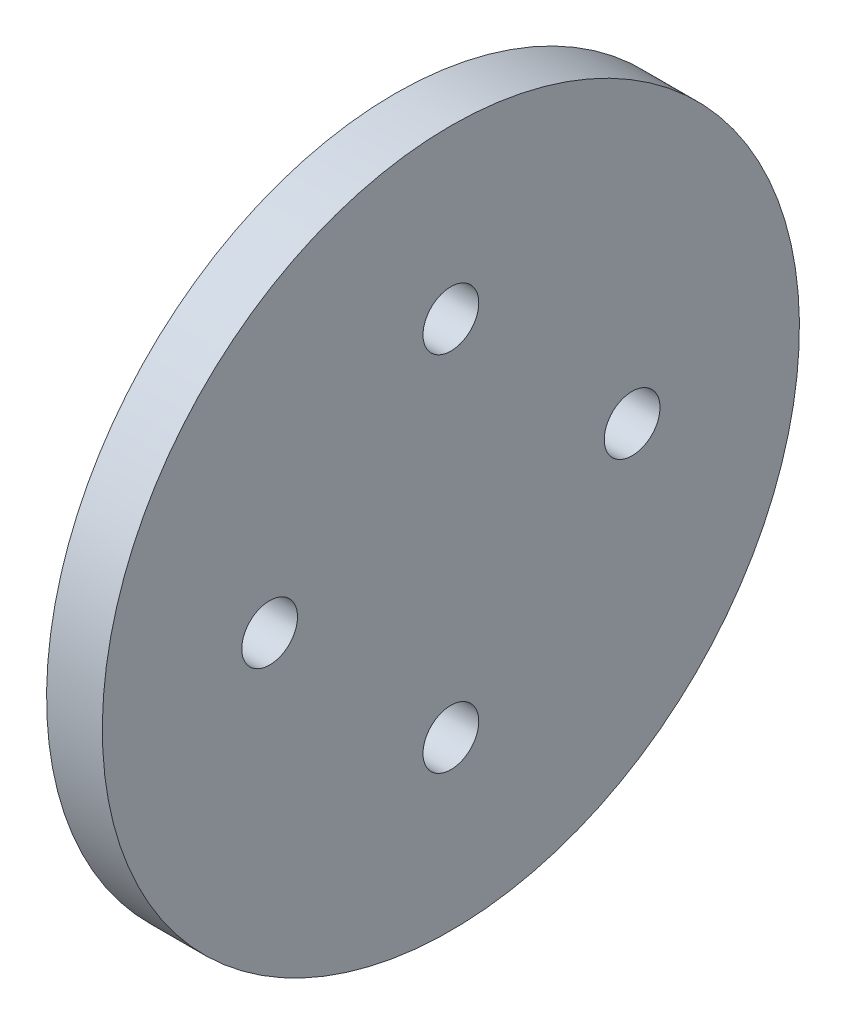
ISO-10303-21;
HEADER;
FILE_DESCRIPTION(('STEP AP214'),'2;1');
FILE_NAME('part.step','',(''),(''),'','','');
FILE_SCHEMA(('AUTOMOTIVE_DESIGN { 1 0 10303 214 1 1 1 1 }'));
ENDSEC;
DATA;
#1=APPLICATION_CONTEXT('core data for automotive mechanical design processes');
#2=APPLICATION_PROTOCOL_DEFINITION('international standard','automotive_design',2000,#1);
#3=PRODUCT_CONTEXT('',#1,'mechanical');
#4=PRODUCT('Part','Part','',(#3));
#5=PRODUCT_RELATED_PRODUCT_CATEGORY('part','',(#4));
#6=PRODUCT_DEFINITION_FORMATION('','',#4);
#7=PRODUCT_DEFINITION_CONTEXT('part definition',#1,'design');
#8=PRODUCT_DEFINITION('design','',#6,#7);
#9=PRODUCT_DEFINITION_SHAPE('','',#8);
#10=(LENGTH_UNIT() NAMED_UNIT(*) SI_UNIT(.MILLI.,.METRE.));
#11=(NAMED_UNIT(*) PLANE_ANGLE_UNIT() SI_UNIT($,.RADIAN.));
#12=(NAMED_UNIT(*) SI_UNIT($,.STERADIAN.) SOLID_ANGLE_UNIT());
#13=UNCERTAINTY_MEASURE_WITH_UNIT(LENGTH_MEASURE(1.E-05),#10,'distance_accuracy_value','');
#14=(GEOMETRIC_REPRESENTATION_CONTEXT(3) GLOBAL_UNCERTAINTY_ASSIGNED_CONTEXT((#13)) GLOBAL_UNIT_ASSIGNED_CONTEXT((#10,
#11,#12)) REPRESENTATION_CONTEXT('',''));
#15=CARTESIAN_POINT('',(0.,0.,0.));
#16=DIRECTION('',(0.,0.,1.));
#17=DIRECTION('',(1.,0.,0.));
#18=AXIS2_PLACEMENT_3D('',#15,#16,#17);
#19=CARTESIAN_POINT('',(0.,0.,0.));
#20=DIRECTION('',(1.,0.,0.));
#21=DIRECTION('',(0.,1.,0.));
#22=AXIS2_PLACEMENT_3D('',#19,#20,#21);
#23=PLANE('',#22);
#24=CARTESIAN_POINT('',(0.,0.,-6.5));
#25=DIRECTION('',(1.,0.,0.));
#26=DIRECTION('',(0.,1.,0.));
#27=AXIS2_PLACEMENT_3D('',#24,#25,#26);
#28=CIRCLE('',#27,1.);
#29=CARTESIAN_POINT('',(0.,1.,-6.5));
#30=VERTEX_POINT('',#29);
#31=EDGE_CURVE('E58',#30,#30,#28,.T.);
#32=ORIENTED_EDGE('',*,*,#31,.F.);
#33=EDGE_LOOP('',(#32));
#34=FACE_BOUND('',#33,.T.);
#35=CARTESIAN_POINT('',(0.,-6.5,0.));
#36=DIRECTION('',(1.,0.,0.));
#37=DIRECTION('',(0.,1.,0.));
#38=AXIS2_PLACEMENT_3D('',#35,#36,#37);
#39=CIRCLE('',#38,1.);
#40=CARTESIAN_POINT('',(0.,-5.5,0.));
#41=VERTEX_POINT('',#40);
#42=EDGE_CURVE('E48',#41,#41,#39,.T.);
#43=ORIENTED_EDGE('',*,*,#42,.F.);
#44=EDGE_LOOP('',(#43));
#45=FACE_BOUND('',#44,.T.);
#46=CARTESIAN_POINT('',(0.,6.5,0.));
#47=DIRECTION('',(1.,0.,0.));
#48=DIRECTION('',(0.,1.,0.));
#49=AXIS2_PLACEMENT_3D('',#46,#47,#48);
#50=CIRCLE('',#49,1.);
#51=CARTESIAN_POINT('',(0.,7.5,0.));
#52=VERTEX_POINT('',#51);
#53=EDGE_CURVE('E45',#52,#52,#50,.T.);
#54=ORIENTED_EDGE('',*,*,#53,.F.);
#55=EDGE_LOOP('',(#54));
#56=FACE_BOUND('',#55,.T.);
#57=CARTESIAN_POINT('',(0.,0.,6.5));
#58=DIRECTION('',(1.,0.,0.));
#59=DIRECTION('',(0.,1.,0.));
#60=AXIS2_PLACEMENT_3D('',#57,#58,#59);
#61=CIRCLE('',#60,1.);
#62=CARTESIAN_POINT('',(0.,1.,6.5));
#63=VERTEX_POINT('',#62);
#64=EDGE_CURVE('E42',#63,#63,#61,.T.);
#65=ORIENTED_EDGE('',*,*,#64,.F.);
#66=EDGE_LOOP('',(#65));
#67=FACE_BOUND('',#66,.T.);
#68=CARTESIAN_POINT('',(0.,0.,0.));
#69=DIRECTION('',(1.,0.,0.));
#70=DIRECTION('',(0.,1.,0.));
#71=AXIS2_PLACEMENT_3D('',#68,#69,#70);
#72=CIRCLE('',#71,12.5);
#73=CARTESIAN_POINT('',(0.,12.5,0.));
#74=VERTEX_POINT('',#73);
#75=EDGE_CURVE('E10',#74,#74,#72,.T.);
#76=ORIENTED_EDGE('',*,*,#75,.T.);
#77=EDGE_LOOP('',(#76));
#78=FACE_BOUND('',#77,.T.);
#79=ADVANCED_FACE('F22',(#34,#45,#56,#67,#78),#23,.T.);
#80=CARTESIAN_POINT('',(0.,0.,0.));
#81=DIRECTION('',(1.,0.,0.));
#82=DIRECTION('',(0.,1.,0.));
#83=AXIS2_PLACEMENT_3D('',#80,#81,#82);
#84=CYLINDRICAL_SURFACE('',#83,12.5);
#85=CARTESIAN_POINT('',(-2.,0.,0.));
#86=DIRECTION('',(1.,0.,0.));
#87=DIRECTION('',(0.,1.,0.));
#88=AXIS2_PLACEMENT_3D('',#85,#86,#87);
#89=CIRCLE('',#88,12.5);
#90=CARTESIAN_POINT('',(-2.,12.5,0.));
#91=VERTEX_POINT('',#90);
#92=EDGE_CURVE('E29',#91,#91,#89,.T.);
#93=ORIENTED_EDGE('',*,*,#92,.T.);
#94=EDGE_LOOP('',(#93));
#95=FACE_BOUND('',#94,.T.);
#96=ORIENTED_EDGE('',*,*,#75,.F.);
#97=EDGE_LOOP('',(#96));
#98=FACE_BOUND('',#97,.T.);
#99=ADVANCED_FACE('F85',(#95,#98),#84,.T.);
#100=CARTESIAN_POINT('',(-2.,12.5,0.));
#101=DIRECTION('',(-1.,0.,0.));
#102=DIRECTION('',(0.,-1.,0.));
#103=AXIS2_PLACEMENT_3D('',#100,#101,#102);
#104=PLANE('',#103);
#105=CARTESIAN_POINT('',(-2.,0.,-6.5));
#106=DIRECTION('',(-1.,0.,0.));
#107=DIRECTION('',(0.,-1.,0.));
#108=AXIS2_PLACEMENT_3D('',#105,#106,#107);
#109=CIRCLE('',#108,1.);
#110=CARTESIAN_POINT('',(-2.,1.,-6.5));
#111=VERTEX_POINT('',#110);
#112=EDGE_CURVE('E25',#111,#111,#109,.T.);
#113=ORIENTED_EDGE('',*,*,#112,.F.);
#114=EDGE_LOOP('',(#113));
#115=FACE_BOUND('',#114,.T.);
#116=CARTESIAN_POINT('',(-2.,-6.5,0.));
#117=DIRECTION('',(-1.,0.,0.));
#118=DIRECTION('',(0.,-1.,0.));
#119=AXIS2_PLACEMENT_3D('',#116,#117,#118);
#120=CIRCLE('',#119,1.);
#121=CARTESIAN_POINT('',(-2.,-5.5,0.));
#122=VERTEX_POINT('',#121);
#123=EDGE_CURVE('E46',#122,#122,#120,.T.);
#124=ORIENTED_EDGE('',*,*,#123,.F.);
#125=EDGE_LOOP('',(#124));
#126=FACE_BOUND('',#125,.T.);
#127=CARTESIAN_POINT('',(-2.,6.5,0.));
#128=DIRECTION('',(-1.,0.,0.));
#129=DIRECTION('',(0.,-1.,0.));
#130=AXIS2_PLACEMENT_3D('',#127,#128,#129);
#131=CIRCLE('',#130,1.);
#132=CARTESIAN_POINT('',(-2.,7.5,0.));
#133=VERTEX_POINT('',#132);
#134=EDGE_CURVE('E43',#133,#133,#131,.T.);
#135=ORIENTED_EDGE('',*,*,#134,.F.);
#136=EDGE_LOOP('',(#135));
#137=FACE_BOUND('',#136,.T.);
#138=CARTESIAN_POINT('',(-2.,0.,6.5));
#139=DIRECTION('',(-1.,0.,0.));
#140=DIRECTION('',(0.,-1.,0.));
#141=AXIS2_PLACEMENT_3D('',#138,#139,#140);
#142=CIRCLE('',#141,1.);
#143=CARTESIAN_POINT('',(-2.,1.,6.5));
#144=VERTEX_POINT('',#143);
#145=EDGE_CURVE('E38',#144,#144,#142,.T.);
#146=ORIENTED_EDGE('',*,*,#145,.F.);
#147=EDGE_LOOP('',(#146));
#148=FACE_BOUND('',#147,.T.);
#149=CARTESIAN_POINT('',(-2.,0.,0.));
#150=DIRECTION('',(1.,0.,0.));
#151=DIRECTION('',(0.,1.,0.));
#152=AXIS2_PLACEMENT_3D('',#149,#150,#151);
#153=CIRCLE('',#152,3.);
#154=CARTESIAN_POINT('',(-2.,3.,0.));
#155=VERTEX_POINT('',#154);
#156=EDGE_CURVE('E34',#155,#155,#153,.T.);
#157=ORIENTED_EDGE('',*,*,#156,.T.);
#158=EDGE_LOOP('',(#157));
#159=FACE_BOUND('',#158,.T.);
#160=ORIENTED_EDGE('',*,*,#92,.F.);
#161=EDGE_LOOP('',(#160));
#162=FACE_BOUND('',#161,.T.);
#163=ADVANCED_FACE('F70',(#115,#126,#137,#148,#159,#162),#104,.T.);
#164=CARTESIAN_POINT('',(0.,0.,0.));
#165=DIRECTION('',(1.,0.,0.));
#166=DIRECTION('',(0.,1.,0.));
#167=AXIS2_PLACEMENT_3D('',#164,#165,#166);
#168=CYLINDRICAL_SURFACE('',#167,3.);
#169=CARTESIAN_POINT('',(-4.,0.,0.));
#170=DIRECTION('',(1.,0.,0.));
#171=DIRECTION('',(0.,1.,0.));
#172=AXIS2_PLACEMENT_3D('',#169,#170,#171);
#173=CIRCLE('',#172,3.);
#174=CARTESIAN_POINT('',(-4.,3.,0.));
#175=VERTEX_POINT('',#174);
#176=EDGE_CURVE('E65',#175,#175,#173,.T.);
#177=ORIENTED_EDGE('',*,*,#176,.T.);
#178=EDGE_LOOP('',(#177));
#179=FACE_BOUND('',#178,.T.);
#180=ORIENTED_EDGE('',*,*,#156,.F.);
#181=EDGE_LOOP('',(#180));
#182=FACE_BOUND('',#181,.T.);
#183=ADVANCED_FACE('F73',(#179,#182),#168,.T.);
#184=CARTESIAN_POINT('',(-4.,0.,0.));
#185=DIRECTION('',(1.,0.,0.));
#186=DIRECTION('',(0.,1.,0.));
#187=AXIS2_PLACEMENT_3D('',#184,#185,#186);
#188=CONICAL_SURFACE('',#187,3.,0.785398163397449);
#189=CARTESIAN_POINT('',(-5.,0.,0.));
#190=DIRECTION('',(1.,0.,0.));
#191=DIRECTION('',(0.,1.,0.));
#192=AXIS2_PLACEMENT_3D('',#189,#190,#191);
#193=CIRCLE('',#192,2.);
#194=CARTESIAN_POINT('',(-5.,2.,0.));
#195=VERTEX_POINT('',#194);
#196=EDGE_CURVE('E41',#195,#195,#193,.T.);
#197=ORIENTED_EDGE('',*,*,#196,.T.);
#198=EDGE_LOOP('',(#197));
#199=FACE_BOUND('',#198,.T.);
#200=ORIENTED_EDGE('',*,*,#176,.F.);
#201=EDGE_LOOP('',(#200));
#202=FACE_BOUND('',#201,.T.);
#203=ADVANCED_FACE('F75',(#199,#202),#188,.T.);
#204=CARTESIAN_POINT('',(-5.,2.,0.));
#205=DIRECTION('',(-1.,0.,0.));
#206=DIRECTION('',(0.,-1.,0.));
#207=AXIS2_PLACEMENT_3D('',#204,#205,#206);
#208=PLANE('',#207);
#209=ORIENTED_EDGE('',*,*,#196,.F.);
#210=EDGE_LOOP('',(#209));
#211=FACE_BOUND('',#210,.T.);
#212=ADVANCED_FACE('F82',(#211),#208,.T.);
#213=CARTESIAN_POINT('',(-5.,0.,6.5));
#214=DIRECTION('',(1.,0.,0.));
#215=DIRECTION('',(0.,1.,0.));
#216=AXIS2_PLACEMENT_3D('',#213,#214,#215);
#217=CYLINDRICAL_SURFACE('',#216,1.);
#218=CARTESIAN_POINT('',(-2.,1.,6.5));
#219=CARTESIAN_POINT('',(-1.97916666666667,1.,6.5));
#220=CARTESIAN_POINT('',(-1.95833333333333,1.,6.5));
#221=CARTESIAN_POINT('',(-1.91666666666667,1.,6.5));
#222=CARTESIAN_POINT('',(-1.89583333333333,1.,6.5));
#223=CARTESIAN_POINT('',(-1.85416666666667,1.,6.5));
#224=CARTESIAN_POINT('',(-1.83333333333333,1.,6.5));
#225=CARTESIAN_POINT('',(-1.79166666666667,1.,6.5));
#226=CARTESIAN_POINT('',(-1.77083333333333,1.,6.5));
#227=CARTESIAN_POINT('',(-1.72916666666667,1.,6.5));
#228=CARTESIAN_POINT('',(-1.70833333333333,1.,6.5));
#229=CARTESIAN_POINT('',(-1.66666666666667,1.,6.5));
#230=CARTESIAN_POINT('',(-1.64583333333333,1.,6.5));
#231=CARTESIAN_POINT('',(-1.60416666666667,1.,6.5));
#232=CARTESIAN_POINT('',(-1.58333333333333,1.,6.5));
#233=CARTESIAN_POINT('',(-1.54166666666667,1.,6.5));
#234=CARTESIAN_POINT('',(-1.52083333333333,1.,6.5));
#235=CARTESIAN_POINT('',(-1.47916666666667,1.,6.5));
#236=CARTESIAN_POINT('',(-1.45833333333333,1.,6.5));
#237=CARTESIAN_POINT('',(-1.41666666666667,1.,6.5));
#238=CARTESIAN_POINT('',(-1.39583333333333,1.,6.5));
#239=CARTESIAN_POINT('',(-1.35416666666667,1.,6.5));
#240=CARTESIAN_POINT('',(-1.33333333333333,1.,6.5));
#241=CARTESIAN_POINT('',(-1.29166666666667,1.,6.5));
#242=CARTESIAN_POINT('',(-1.27083333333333,1.,6.5));
#243=CARTESIAN_POINT('',(-1.22916666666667,1.,6.5));
#244=CARTESIAN_POINT('',(-1.20833333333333,1.,6.5));
#245=CARTESIAN_POINT('',(-1.16666666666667,1.,6.5));
#246=CARTESIAN_POINT('',(-1.14583333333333,1.,6.5));
#247=CARTESIAN_POINT('',(-1.10416666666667,1.,6.5));
#248=CARTESIAN_POINT('',(-1.08333333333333,1.,6.5));
#249=CARTESIAN_POINT('',(-1.04166666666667,1.,6.5));
#250=CARTESIAN_POINT('',(-1.02083333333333,1.,6.5));
#251=CARTESIAN_POINT('',(-0.979166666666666,1.,6.5));
#252=CARTESIAN_POINT('',(-0.958333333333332,1.,6.5));
#253=CARTESIAN_POINT('',(-0.916666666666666,1.,6.5));
#254=CARTESIAN_POINT('',(-0.895833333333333,1.,6.5));
#255=CARTESIAN_POINT('',(-0.854166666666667,1.,6.5));
#256=CARTESIAN_POINT('',(-0.833333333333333,1.,6.5));
#257=CARTESIAN_POINT('',(-0.791666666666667,1.,6.5));
#258=CARTESIAN_POINT('',(-0.770833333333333,1.,6.5));
#259=CARTESIAN_POINT('',(-0.729166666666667,1.,6.5));
#260=CARTESIAN_POINT('',(-0.708333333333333,1.,6.5));
#261=CARTESIAN_POINT('',(-0.666666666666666,1.,6.5));
#262=CARTESIAN_POINT('',(-0.645833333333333,1.,6.5));
#263=CARTESIAN_POINT('',(-0.604166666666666,1.,6.5));
#264=CARTESIAN_POINT('',(-0.583333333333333,1.,6.5));
#265=CARTESIAN_POINT('',(-0.541666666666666,1.,6.5));
#266=CARTESIAN_POINT('',(-0.520833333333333,1.,6.5));
#267=CARTESIAN_POINT('',(-0.479166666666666,1.,6.5));
#268=CARTESIAN_POINT('',(-0.458333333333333,1.,6.5));
#269=CARTESIAN_POINT('',(-0.416666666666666,1.,6.5));
#270=CARTESIAN_POINT('',(-0.395833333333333,1.,6.5));
#271=CARTESIAN_POINT('',(-0.354166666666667,1.,6.5));
#272=CARTESIAN_POINT('',(-0.333333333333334,1.,6.5));
#273=CARTESIAN_POINT('',(-0.291666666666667,1.,6.5));
#274=CARTESIAN_POINT('',(-0.270833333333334,1.,6.5));
#275=CARTESIAN_POINT('',(-0.229166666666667,1.,6.5));
#276=CARTESIAN_POINT('',(-0.208333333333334,1.,6.5));
#277=CARTESIAN_POINT('',(-0.166666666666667,1.,6.5));
#278=CARTESIAN_POINT('',(-0.145833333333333,1.,6.5));
#279=CARTESIAN_POINT('',(-0.104166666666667,1.,6.5));
#280=CARTESIAN_POINT('',(-0.0833333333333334,1.,6.5));
#281=CARTESIAN_POINT('',(-0.0416666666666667,1.,6.5));
#282=CARTESIAN_POINT('',(-0.0208333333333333,1.,6.5));
#283=CARTESIAN_POINT('',(0.,1.,6.5));
#284=B_SPLINE_CURVE_WITH_KNOTS('',3,(#218,#219,#220,#221,#222,#223,#224,#225,#226,#227,#228,
#229,#230,#231,#232,#233,#234,#235,#236,#237,#238,#239,#240,#241,#242,#243,#244,#245,#246,#247,
#248,#249,#250,#251,#252,#253,#254,#255,#256,#257,#258,#259,#260,#261,#262,#263,#264,#265,#266,
#267,#268,#269,#270,#271,#272,#273,#274,#275,#276,#277,#278,#279,#280,#281,#282,#283),
.UNSPECIFIED.,.F.,.F.,(4,2,2,2,2,2,2,2,2,2,2,2,2,2,2,2,2,2,2,2,2,2,2,2,2,2,2,2,2,2,2,2,4),(0.,
0.0625000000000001,0.125,0.1875,0.25,0.3125,0.375,0.4375,0.5,0.5625,0.625,0.6875,0.75,0.8125,
0.875,0.9375,1.,1.0625,1.125,1.1875,1.25,1.3125,1.375,1.4375,1.5,1.5625,1.625,1.6875,1.75,
1.8125,1.875,1.9375,2.),.UNSPECIFIED.);
#285=EDGE_CURVE('BSEAM102',#144,#63,#284,.T.);
#286=ORIENTED_EDGE('',*,*,#145,.T.);
#287=ORIENTED_EDGE('',*,*,#64,.T.);
#288=ORIENTED_EDGE('',*,*,#285,.T.);
#289=ORIENTED_EDGE('',*,*,#285,.F.);
#290=EDGE_LOOP('',(#286,#288,#287,#289));
#291=FACE_BOUND('',#290,.T.);
#292=ADVANCED_FACE('F102',(#291),#217,.F.);
#293=CARTESIAN_POINT('',(-5.,6.5,0.));
#294=DIRECTION('',(1.,0.,0.));
#295=DIRECTION('',(0.,1.,0.));
#296=AXIS2_PLACEMENT_3D('',#293,#294,#295);
#297=CYLINDRICAL_SURFACE('',#296,1.);
#298=CARTESIAN_POINT('',(-2.,7.5,0.));
#299=CARTESIAN_POINT('',(-1.97916666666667,7.5,0.));
#300=CARTESIAN_POINT('',(-1.95833333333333,7.5,0.));
#301=CARTESIAN_POINT('',(-1.91666666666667,7.5,0.));
#302=CARTESIAN_POINT('',(-1.89583333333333,7.5,0.));
#303=CARTESIAN_POINT('',(-1.85416666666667,7.5,0.));
#304=CARTESIAN_POINT('',(-1.83333333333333,7.5,0.));
#305=CARTESIAN_POINT('',(-1.79166666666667,7.5,0.));
#306=CARTESIAN_POINT('',(-1.77083333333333,7.5,0.));
#307=CARTESIAN_POINT('',(-1.72916666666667,7.5,0.));
#308=CARTESIAN_POINT('',(-1.70833333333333,7.5,0.));
#309=CARTESIAN_POINT('',(-1.66666666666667,7.5,0.));
#310=CARTESIAN_POINT('',(-1.64583333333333,7.5,0.));
#311=CARTESIAN_POINT('',(-1.60416666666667,7.5,0.));
#312=CARTESIAN_POINT('',(-1.58333333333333,7.5,0.));
#313=CARTESIAN_POINT('',(-1.54166666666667,7.5,0.));
#314=CARTESIAN_POINT('',(-1.52083333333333,7.5,0.));
#315=CARTESIAN_POINT('',(-1.47916666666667,7.5,0.));
#316=CARTESIAN_POINT('',(-1.45833333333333,7.5,0.));
#317=CARTESIAN_POINT('',(-1.41666666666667,7.5,0.));
#318=CARTESIAN_POINT('',(-1.39583333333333,7.5,0.));
#319=CARTESIAN_POINT('',(-1.35416666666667,7.5,0.));
#320=CARTESIAN_POINT('',(-1.33333333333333,7.5,0.));
#321=CARTESIAN_POINT('',(-1.29166666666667,7.5,0.));
#322=CARTESIAN_POINT('',(-1.27083333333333,7.5,0.));
#323=CARTESIAN_POINT('',(-1.22916666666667,7.5,0.));
#324=CARTESIAN_POINT('',(-1.20833333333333,7.5,0.));
#325=CARTESIAN_POINT('',(-1.16666666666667,7.5,0.));
#326=CARTESIAN_POINT('',(-1.14583333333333,7.5,0.));
#327=CARTESIAN_POINT('',(-1.10416666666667,7.5,0.));
#328=CARTESIAN_POINT('',(-1.08333333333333,7.5,0.));
#329=CARTESIAN_POINT('',(-1.04166666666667,7.5,0.));
#330=CARTESIAN_POINT('',(-1.02083333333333,7.5,0.));
#331=CARTESIAN_POINT('',(-0.979166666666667,7.5,0.));
#332=CARTESIAN_POINT('',(-0.958333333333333,7.5,0.));
#333=CARTESIAN_POINT('',(-0.916666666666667,7.5,0.));
#334=CARTESIAN_POINT('',(-0.895833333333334,7.5,0.));
#335=CARTESIAN_POINT('',(-0.854166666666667,7.5,0.));
#336=CARTESIAN_POINT('',(-0.833333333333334,7.5,0.));
#337=CARTESIAN_POINT('',(-0.791666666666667,7.5,0.));
#338=CARTESIAN_POINT('',(-0.770833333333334,7.5,0.));
#339=CARTESIAN_POINT('',(-0.729166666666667,7.5,0.));
#340=CARTESIAN_POINT('',(-0.708333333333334,7.5,0.));
#341=CARTESIAN_POINT('',(-0.666666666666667,7.5,0.));
#342=CARTESIAN_POINT('',(-0.645833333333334,7.5,0.));
#343=CARTESIAN_POINT('',(-0.604166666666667,7.5,0.));
#344=CARTESIAN_POINT('',(-0.583333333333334,7.5,0.));
#345=CARTESIAN_POINT('',(-0.541666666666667,7.5,0.));
#346=CARTESIAN_POINT('',(-0.520833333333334,7.5,0.));
#347=CARTESIAN_POINT('',(-0.479166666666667,7.5,0.));
#348=CARTESIAN_POINT('',(-0.458333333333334,7.5,0.));
#349=CARTESIAN_POINT('',(-0.416666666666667,7.5,0.));
#350=CARTESIAN_POINT('',(-0.395833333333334,7.5,0.));
#351=CARTESIAN_POINT('',(-0.354166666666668,7.5,0.));
#352=CARTESIAN_POINT('',(-0.333333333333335,7.5,0.));
#353=CARTESIAN_POINT('',(-0.291666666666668,7.5,0.));
#354=CARTESIAN_POINT('',(-0.270833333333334,7.5,0.));
#355=CARTESIAN_POINT('',(-0.229166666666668,7.5,0.));
#356=CARTESIAN_POINT('',(-0.208333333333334,7.5,0.));
#357=CARTESIAN_POINT('',(-0.166666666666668,7.5,0.));
#358=CARTESIAN_POINT('',(-0.145833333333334,7.5,0.));
#359=CARTESIAN_POINT('',(-0.104166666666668,7.5,0.));
#360=CARTESIAN_POINT('',(-0.0833333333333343,7.5,0.));
#361=CARTESIAN_POINT('',(-0.0416666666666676,7.5,0.));
#362=CARTESIAN_POINT('',(-0.0208333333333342,7.5,0.));
#363=CARTESIAN_POINT('',(0.,7.5,0.));
#364=B_SPLINE_CURVE_WITH_KNOTS('',3,(#298,#299,#300,#301,#302,#303,#304,#305,#306,#307,#308,
#309,#310,#311,#312,#313,#314,#315,#316,#317,#318,#319,#320,#321,#322,#323,#324,#325,#326,#327,
#328,#329,#330,#331,#332,#333,#334,#335,#336,#337,#338,#339,#340,#341,#342,#343,#344,#345,#346,
#347,#348,#349,#350,#351,#352,#353,#354,#355,#356,#357,#358,#359,#360,#361,#362,#363),
.UNSPECIFIED.,.F.,.F.,(4,2,2,2,2,2,2,2,2,2,2,2,2,2,2,2,2,2,2,2,2,2,2,2,2,2,2,2,2,2,2,2,4),(0.,
0.0625000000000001,0.125,0.1875,0.25,0.3125,0.375,0.4375,0.5,0.5625,0.625,0.6875,0.75,0.8125,
0.875,0.9375,1.,1.0625,1.125,1.1875,1.25,1.3125,1.375,1.4375,1.5,1.5625,1.625,1.6875,1.75,
1.8125,1.875,1.9375,2.),.UNSPECIFIED.);
#365=EDGE_CURVE('BSEAM104',#133,#52,#364,.T.);
#366=ORIENTED_EDGE('',*,*,#134,.T.);
#367=ORIENTED_EDGE('',*,*,#53,.T.);
#368=ORIENTED_EDGE('',*,*,#365,.T.);
#369=ORIENTED_EDGE('',*,*,#365,.F.);
#370=EDGE_LOOP('',(#366,#368,#367,#369));
#371=FACE_BOUND('',#370,.T.);
#372=ADVANCED_FACE('F104',(#371),#297,.F.);
#373=CARTESIAN_POINT('',(-5.,-6.5,0.));
#374=DIRECTION('',(1.,0.,0.));
#375=DIRECTION('',(0.,1.,0.));
#376=AXIS2_PLACEMENT_3D('',#373,#374,#375);
#377=CYLINDRICAL_SURFACE('',#376,1.);
#378=CARTESIAN_POINT('',(-2.,-5.5,0.));
#379=CARTESIAN_POINT('',(-1.97916666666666,-5.5,0.));
#380=CARTESIAN_POINT('',(-1.95833333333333,-5.5,0.));
#381=CARTESIAN_POINT('',(-1.91666666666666,-5.5,0.));
#382=CARTESIAN_POINT('',(-1.89583333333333,-5.5,0.));
#383=CARTESIAN_POINT('',(-1.85416666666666,-5.5,0.));
#384=CARTESIAN_POINT('',(-1.83333333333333,-5.5,0.));
#385=CARTESIAN_POINT('',(-1.79166666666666,-5.5,0.));
#386=CARTESIAN_POINT('',(-1.77083333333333,-5.5,0.));
#387=CARTESIAN_POINT('',(-1.72916666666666,-5.5,0.));
#388=CARTESIAN_POINT('',(-1.70833333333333,-5.5,0.));
#389=CARTESIAN_POINT('',(-1.66666666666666,-5.5,0.));
#390=CARTESIAN_POINT('',(-1.64583333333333,-5.5,0.));
#391=CARTESIAN_POINT('',(-1.60416666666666,-5.5,0.));
#392=CARTESIAN_POINT('',(-1.58333333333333,-5.5,0.));
#393=CARTESIAN_POINT('',(-1.54166666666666,-5.5,0.));
#394=CARTESIAN_POINT('',(-1.52083333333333,-5.5,0.));
#395=CARTESIAN_POINT('',(-1.47916666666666,-5.5,0.));
#396=CARTESIAN_POINT('',(-1.45833333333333,-5.5,0.));
#397=CARTESIAN_POINT('',(-1.41666666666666,-5.5,0.));
#398=CARTESIAN_POINT('',(-1.39583333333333,-5.5,0.));
#399=CARTESIAN_POINT('',(-1.35416666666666,-5.5,0.));
#400=CARTESIAN_POINT('',(-1.33333333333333,-5.5,0.));
#401=CARTESIAN_POINT('',(-1.29166666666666,-5.5,0.));
#402=CARTESIAN_POINT('',(-1.27083333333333,-5.5,0.));
#403=CARTESIAN_POINT('',(-1.22916666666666,-5.5,0.));
#404=CARTESIAN_POINT('',(-1.20833333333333,-5.5,0.));
#405=CARTESIAN_POINT('',(-1.16666666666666,-5.5,0.));
#406=CARTESIAN_POINT('',(-1.14583333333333,-5.5,0.));
#407=CARTESIAN_POINT('',(-1.10416666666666,-5.5,0.));
#408=CARTESIAN_POINT('',(-1.08333333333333,-5.5,0.));
#409=CARTESIAN_POINT('',(-1.04166666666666,-5.5,0.));
#410=CARTESIAN_POINT('',(-1.02083333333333,-5.5,0.));
#411=CARTESIAN_POINT('',(-0.979166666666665,-5.5,0.));
#412=CARTESIAN_POINT('',(-0.958333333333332,-5.5,0.));
#413=CARTESIAN_POINT('',(-0.916666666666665,-5.5,0.));
#414=CARTESIAN_POINT('',(-0.895833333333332,-5.5,0.));
#415=CARTESIAN_POINT('',(-0.854166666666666,-5.5,0.));
#416=CARTESIAN_POINT('',(-0.833333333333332,-5.5,0.));
#417=CARTESIAN_POINT('',(-0.791666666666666,-5.5,0.));
#418=CARTESIAN_POINT('',(-0.770833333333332,-5.5,0.));
#419=CARTESIAN_POINT('',(-0.729166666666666,-5.5,0.));
#420=CARTESIAN_POINT('',(-0.708333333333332,-5.5,0.));
#421=CARTESIAN_POINT('',(-0.666666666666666,-5.5,0.));
#422=CARTESIAN_POINT('',(-0.645833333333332,-5.5,0.));
#423=CARTESIAN_POINT('',(-0.604166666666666,-5.5,0.));
#424=CARTESIAN_POINT('',(-0.583333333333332,-5.5,0.));
#425=CARTESIAN_POINT('',(-0.541666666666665,-5.5,0.));
#426=CARTESIAN_POINT('',(-0.520833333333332,-5.5,0.));
#427=CARTESIAN_POINT('',(-0.479166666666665,-5.5,0.));
#428=CARTESIAN_POINT('',(-0.458333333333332,-5.5,0.));
#429=CARTESIAN_POINT('',(-0.416666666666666,-5.5,0.));
#430=CARTESIAN_POINT('',(-0.395833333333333,-5.5,0.));
#431=CARTESIAN_POINT('',(-0.354166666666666,-5.5,0.));
#432=CARTESIAN_POINT('',(-0.333333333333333,-5.5,0.));
#433=CARTESIAN_POINT('',(-0.291666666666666,-5.5,0.));
#434=CARTESIAN_POINT('',(-0.270833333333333,-5.5,0.));
#435=CARTESIAN_POINT('',(-0.229166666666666,-5.5,0.));
#436=CARTESIAN_POINT('',(-0.208333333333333,-5.5,0.));
#437=CARTESIAN_POINT('',(-0.166666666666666,-5.5,0.));
#438=CARTESIAN_POINT('',(-0.145833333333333,-5.5,0.));
#439=CARTESIAN_POINT('',(-0.104166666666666,-5.5,0.));
#440=CARTESIAN_POINT('',(-0.0833333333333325,-5.5,0.));
#441=CARTESIAN_POINT('',(-0.0416666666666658,-5.5,0.));
#442=CARTESIAN_POINT('',(-0.0208333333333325,-5.5,0.));
#443=CARTESIAN_POINT('',(0.,-5.5,0.));
#444=B_SPLINE_CURVE_WITH_KNOTS('',3,(#378,#379,#380,#381,#382,#383,#384,#385,#386,#387,#388,
#389,#390,#391,#392,#393,#394,#395,#396,#397,#398,#399,#400,#401,#402,#403,#404,#405,#406,#407,
#408,#409,#410,#411,#412,#413,#414,#415,#416,#417,#418,#419,#420,#421,#422,#423,#424,#425,#426,
#427,#428,#429,#430,#431,#432,#433,#434,#435,#436,#437,#438,#439,#440,#441,#442,#443),
.UNSPECIFIED.,.F.,.F.,(4,2,2,2,2,2,2,2,2,2,2,2,2,2,2,2,2,2,2,2,2,2,2,2,2,2,2,2,2,2,2,2,4),(0.,
0.0625000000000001,0.125,0.1875,0.25,0.3125,0.375,0.4375,0.5,0.5625,0.625,0.6875,0.75,0.8125,
0.875,0.9375,1.,1.0625,1.125,1.1875,1.25,1.3125,1.375,1.4375,1.5,1.5625,1.625,1.6875,1.75,
1.8125,1.875,1.9375,2.),.UNSPECIFIED.);
#445=EDGE_CURVE('BSEAM111',#122,#41,#444,.T.);
#446=ORIENTED_EDGE('',*,*,#123,.T.);
#447=ORIENTED_EDGE('',*,*,#42,.T.);
#448=ORIENTED_EDGE('',*,*,#445,.T.);
#449=ORIENTED_EDGE('',*,*,#445,.F.);
#450=EDGE_LOOP('',(#446,#448,#447,#449));
#451=FACE_BOUND('',#450,.T.);
#452=ADVANCED_FACE('F111',(#451),#377,.F.);
#453=CARTESIAN_POINT('',(-5.,0.,-6.5));
#454=DIRECTION('',(1.,0.,0.));
#455=DIRECTION('',(0.,1.,0.));
#456=AXIS2_PLACEMENT_3D('',#453,#454,#455);
#457=CYLINDRICAL_SURFACE('',#456,1.);
#458=CARTESIAN_POINT('',(-2.,1.,-6.5));
#459=CARTESIAN_POINT('',(-1.97916666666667,1.,-6.5));
#460=CARTESIAN_POINT('',(-1.95833333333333,1.,-6.5));
#461=CARTESIAN_POINT('',(-1.91666666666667,1.,-6.5));
#462=CARTESIAN_POINT('',(-1.89583333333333,1.,-6.5));
#463=CARTESIAN_POINT('',(-1.85416666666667,1.,-6.5));
#464=CARTESIAN_POINT('',(-1.83333333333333,1.,-6.5));
#465=CARTESIAN_POINT('',(-1.79166666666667,1.,-6.5));
#466=CARTESIAN_POINT('',(-1.77083333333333,1.,-6.5));
#467=CARTESIAN_POINT('',(-1.72916666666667,1.,-6.5));
#468=CARTESIAN_POINT('',(-1.70833333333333,1.,-6.5));
#469=CARTESIAN_POINT('',(-1.66666666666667,1.,-6.5));
#470=CARTESIAN_POINT('',(-1.64583333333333,1.,-6.5));
#471=CARTESIAN_POINT('',(-1.60416666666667,1.,-6.5));
#472=CARTESIAN_POINT('',(-1.58333333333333,1.,-6.5));
#473=CARTESIAN_POINT('',(-1.54166666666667,1.,-6.5));
#474=CARTESIAN_POINT('',(-1.52083333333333,1.,-6.5));
#475=CARTESIAN_POINT('',(-1.47916666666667,1.,-6.5));
#476=CARTESIAN_POINT('',(-1.45833333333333,1.,-6.5));
#477=CARTESIAN_POINT('',(-1.41666666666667,1.,-6.5));
#478=CARTESIAN_POINT('',(-1.39583333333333,1.,-6.5));
#479=CARTESIAN_POINT('',(-1.35416666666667,1.,-6.5));
#480=CARTESIAN_POINT('',(-1.33333333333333,1.,-6.5));
#481=CARTESIAN_POINT('',(-1.29166666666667,1.,-6.5));
#482=CARTESIAN_POINT('',(-1.27083333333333,1.,-6.5));
#483=CARTESIAN_POINT('',(-1.22916666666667,1.,-6.5));
#484=CARTESIAN_POINT('',(-1.20833333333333,1.,-6.5));
#485=CARTESIAN_POINT('',(-1.16666666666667,1.,-6.5));
#486=CARTESIAN_POINT('',(-1.14583333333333,1.,-6.5));
#487=CARTESIAN_POINT('',(-1.10416666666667,1.,-6.5));
#488=CARTESIAN_POINT('',(-1.08333333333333,1.,-6.5));
#489=CARTESIAN_POINT('',(-1.04166666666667,1.,-6.5));
#490=CARTESIAN_POINT('',(-1.02083333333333,1.,-6.5));
#491=CARTESIAN_POINT('',(-0.979166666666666,1.,-6.5));
#492=CARTESIAN_POINT('',(-0.958333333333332,1.,-6.5));
#493=CARTESIAN_POINT('',(-0.916666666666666,1.,-6.5));
#494=CARTESIAN_POINT('',(-0.895833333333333,1.,-6.5));
#495=CARTESIAN_POINT('',(-0.854166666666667,1.,-6.5));
#496=CARTESIAN_POINT('',(-0.833333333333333,1.,-6.5));
#497=CARTESIAN_POINT('',(-0.791666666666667,1.,-6.5));
#498=CARTESIAN_POINT('',(-0.770833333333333,1.,-6.5));
#499=CARTESIAN_POINT('',(-0.729166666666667,1.,-6.5));
#500=CARTESIAN_POINT('',(-0.708333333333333,1.,-6.5));
#501=CARTESIAN_POINT('',(-0.666666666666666,1.,-6.5));
#502=CARTESIAN_POINT('',(-0.645833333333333,1.,-6.5));
#503=CARTESIAN_POINT('',(-0.604166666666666,1.,-6.5));
#504=CARTESIAN_POINT('',(-0.583333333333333,1.,-6.5));
#505=CARTESIAN_POINT('',(-0.541666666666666,1.,-6.5));
#506=CARTESIAN_POINT('',(-0.520833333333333,1.,-6.5));
#507=CARTESIAN_POINT('',(-0.479166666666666,1.,-6.5));
#508=CARTESIAN_POINT('',(-0.458333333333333,1.,-6.5));
#509=CARTESIAN_POINT('',(-0.416666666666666,1.,-6.5));
#510=CARTESIAN_POINT('',(-0.395833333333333,1.,-6.5));
#511=CARTESIAN_POINT('',(-0.354166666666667,1.,-6.5));
#512=CARTESIAN_POINT('',(-0.333333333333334,1.,-6.5));
#513=CARTESIAN_POINT('',(-0.291666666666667,1.,-6.5));
#514=CARTESIAN_POINT('',(-0.270833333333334,1.,-6.5));
#515=CARTESIAN_POINT('',(-0.229166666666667,1.,-6.5));
#516=CARTESIAN_POINT('',(-0.208333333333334,1.,-6.5));
#517=CARTESIAN_POINT('',(-0.166666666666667,1.,-6.5));
#518=CARTESIAN_POINT('',(-0.145833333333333,1.,-6.5));
#519=CARTESIAN_POINT('',(-0.104166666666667,1.,-6.5));
#520=CARTESIAN_POINT('',(-0.0833333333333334,1.,-6.5));
#521=CARTESIAN_POINT('',(-0.0416666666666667,1.,-6.5));
#522=CARTESIAN_POINT('',(-0.0208333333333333,1.,-6.5));
#523=CARTESIAN_POINT('',(0.,1.,-6.5));
#524=B_SPLINE_CURVE_WITH_KNOTS('',3,(#458,#459,#460,#461,#462,#463,#464,#465,#466,#467,#468,
#469,#470,#471,#472,#473,#474,#475,#476,#477,#478,#479,#480,#481,#482,#483,#484,#485,#486,#487,
#488,#489,#490,#491,#492,#493,#494,#495,#496,#497,#498,#499,#500,#501,#502,#503,#504,#505,#506,
#507,#508,#509,#510,#511,#512,#513,#514,#515,#516,#517,#518,#519,#520,#521,#522,#523),
.UNSPECIFIED.,.F.,.F.,(4,2,2,2,2,2,2,2,2,2,2,2,2,2,2,2,2,2,2,2,2,2,2,2,2,2,2,2,2,2,2,2,4),(0.,
0.0625000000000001,0.125,0.1875,0.25,0.3125,0.375,0.4375,0.5,0.5625,0.625,0.6875,0.75,0.8125,
0.875,0.9375,1.,1.0625,1.125,1.1875,1.25,1.3125,1.375,1.4375,1.5,1.5625,1.625,1.6875,1.75,
1.8125,1.875,1.9375,2.),.UNSPECIFIED.);
#525=EDGE_CURVE('BSEAM119',#111,#30,#524,.T.);
#526=ORIENTED_EDGE('',*,*,#112,.T.);
#527=ORIENTED_EDGE('',*,*,#31,.T.);
#528=ORIENTED_EDGE('',*,*,#525,.T.);
#529=ORIENTED_EDGE('',*,*,#525,.F.);
#530=EDGE_LOOP('',(#526,#528,#527,#529));
#531=FACE_BOUND('',#530,.T.);
#532=ADVANCED_FACE('F119',(#531),#457,.F.);
#533=CLOSED_SHELL('',(#79,#99,#163,#183,#203,#212,#292,#372,#452,#532));
#534=MANIFOLD_SOLID_BREP('B2',#533);
#535=ADVANCED_BREP_SHAPE_REPRESENTATION('',(#18,#534),#14);
#536=SHAPE_DEFINITION_REPRESENTATION(#9,#535);
ENDSEC;
END-ISO-10303-21;
